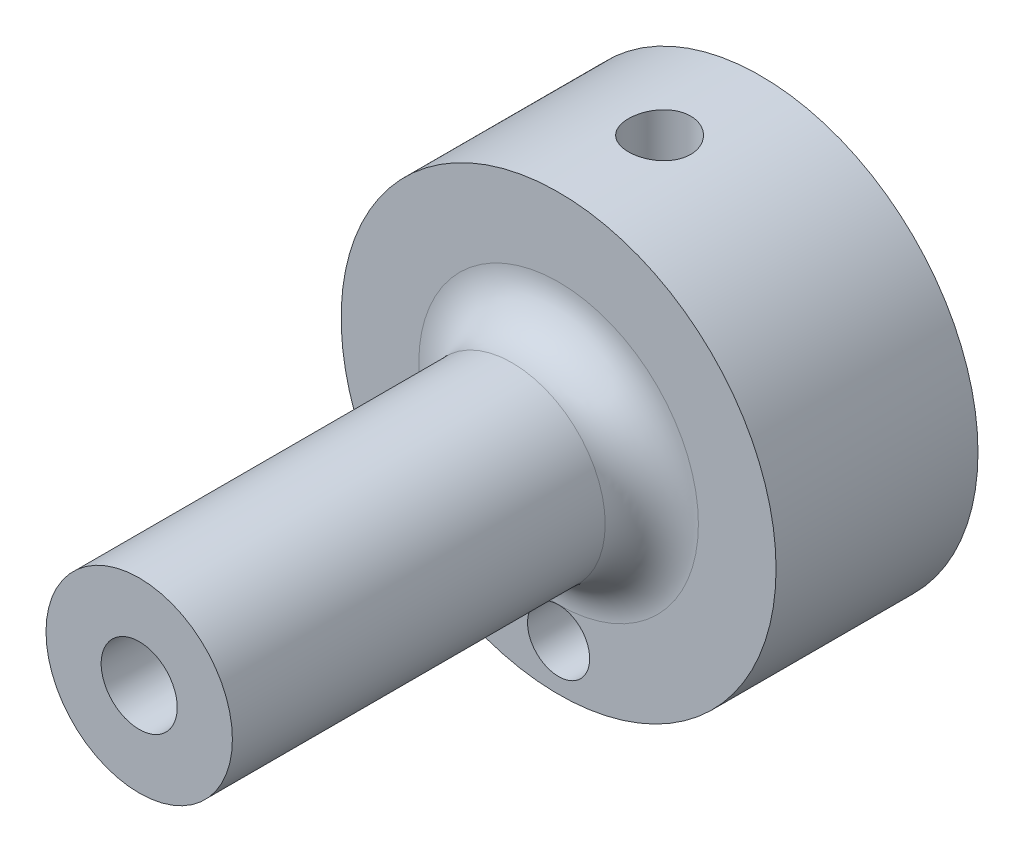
from build123d import *


with BuildPart() as part:
    # Sketch1 → Revolve1 (revolve)
    with BuildSketch(Plane(origin=(0, 0, 0), x_dir=(0, 0, -1), z_dir=(1, 0, 0)), mode=Mode.PRIVATE) as revolve1_sk:
        with BuildLine():
            Line((-27, 2.448202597), (13, 1.75))
            Line((13, 1.75), (13, 14))
            Line((13, 14), (0, 14))
            Line((0, 14), (0, 9))
            ThreePointArc((0, 9), (-0.878679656, 6.878679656), (-3, 6))
            Line((-3, 6), (-27, 6))
            Line((-27, 6), (-27, 2.448202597))
        make_face()
    revolve(revolve1_sk.sketch.rotate(Axis((0, 0, 27), (0, 0, -1)), 90), axis=Axis((0, 0, 27), (0, 0, -1)))

    # Sketch2 → Cut-Revolve1 (revolve, cut)
    with BuildSketch(Plane(origin=(0, 0, 0), x_dir=(0, 0, -1), z_dir=(1, 0, 0)), mode=Mode.PRIVATE) as cut_revolve1_sk:
        Polygon((8.5, 14), (6.5, 14), (6.5, 6.798278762), (8.5, 8), align=None)
    revolve(cut_revolve1_sk.sketch.rotate(Axis((0, 14, -6.5), (0, -1, 0)), 180), axis=Axis((0, 14, -6.5), (0, -1, 0)), mode=Mode.SUBTRACT)

    # Sketch3 → Cut-Revolve2 (revolve, cut)
    with BuildSketch(Plane(origin=(0, -17.5, -14), x_dir=(0, 1, 0), z_dir=(1, 0, 0)), mode=Mode.PRIVATE) as cut_revolve2_sk:
        Polygon((8.5, 14), (6.5, 14), (6.5, 6.798278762), (8.5, 8), align=None)
    revolve(cut_revolve2_sk.sketch.rotate(Axis((0, -11, 0), (0, 0, -1)), 90), axis=Axis((0, -11, 0), (0, 0, -1)), mode=Mode.SUBTRACT)

    # Sketch4 → Cut-Revolve3 (revolve, cut)
    with BuildSketch(Plane(origin=(0, 0, 0), x_dir=(0, 0, -1), z_dir=(1, 0, 0)), mode=Mode.PRIVATE) as cut_revolve3_sk:
        with BuildLine():
            Line((13, 0), (13, 6.652067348))
            ThreePointArc((13, 6.652067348), (11.879649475, 3.409545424), (11.5, 0))
            Line((11.5, 0), (13, 0))
        make_face()
    revolve(cut_revolve3_sk.sketch.rotate(Axis((0, 0, -11.5), (0, 0, -1)), 90), axis=Axis((0, 0, -11.5), (0, 0, -1)), mode=Mode.SUBTRACT)


solid = part.part
